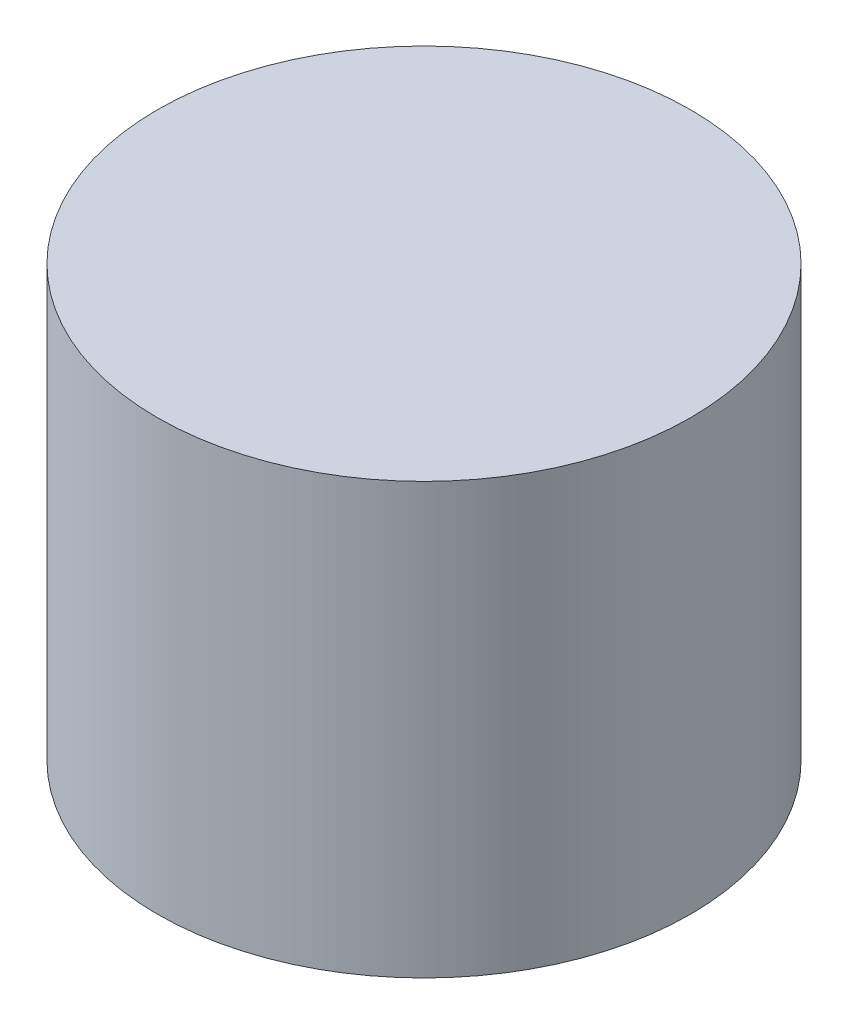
ISO-10303-21;
HEADER;
FILE_DESCRIPTION(('STEP AP214'),'2;1');
FILE_NAME('part.step','',(''),(''),'','','');
FILE_SCHEMA(('AUTOMOTIVE_DESIGN { 1 0 10303 214 1 1 1 1 }'));
ENDSEC;
DATA;
#1=APPLICATION_CONTEXT('core data for automotive mechanical design processes');
#2=APPLICATION_PROTOCOL_DEFINITION('international standard','automotive_design',2000,#1);
#3=PRODUCT_CONTEXT('',#1,'mechanical');
#4=PRODUCT('Part','Part','',(#3));
#5=PRODUCT_RELATED_PRODUCT_CATEGORY('part','',(#4));
#6=PRODUCT_DEFINITION_FORMATION('','',#4);
#7=PRODUCT_DEFINITION_CONTEXT('part definition',#1,'design');
#8=PRODUCT_DEFINITION('design','',#6,#7);
#9=PRODUCT_DEFINITION_SHAPE('','',#8);
#10=(LENGTH_UNIT() NAMED_UNIT(*) SI_UNIT(.MILLI.,.METRE.));
#11=(NAMED_UNIT(*) PLANE_ANGLE_UNIT() SI_UNIT($,.RADIAN.));
#12=(NAMED_UNIT(*) SI_UNIT($,.STERADIAN.) SOLID_ANGLE_UNIT());
#13=UNCERTAINTY_MEASURE_WITH_UNIT(LENGTH_MEASURE(1.E-05),#10,'distance_accuracy_value','');
#14=(GEOMETRIC_REPRESENTATION_CONTEXT(3) GLOBAL_UNCERTAINTY_ASSIGNED_CONTEXT((#13)) GLOBAL_UNIT_ASSIGNED_CONTEXT((#10,
#11,#12)) REPRESENTATION_CONTEXT('',''));
#15=CARTESIAN_POINT('',(0.,0.,0.));
#16=DIRECTION('',(0.,0.,1.));
#17=DIRECTION('',(1.,0.,0.));
#18=AXIS2_PLACEMENT_3D('',#15,#16,#17);
#19=CARTESIAN_POINT('',(0.,50.8,0.));
#20=DIRECTION('',(0.,-1.,0.));
#21=DIRECTION('',(0.,0.,-1.));
#22=AXIS2_PLACEMENT_3D('',#19,#20,#21);
#23=CYLINDRICAL_SURFACE('',#22,31.496);
#24=CARTESIAN_POINT('',(0.,50.8,0.));
#25=DIRECTION('',(0.,1.,0.));
#26=DIRECTION('',(0.,0.,1.));
#27=AXIS2_PLACEMENT_3D('',#24,#25,#26);
#28=CIRCLE('',#27,31.496);
#29=CARTESIAN_POINT('',(0.,50.8,31.496));
#30=VERTEX_POINT('',#29);
#31=EDGE_CURVE('E10',#30,#30,#28,.T.);
#32=ORIENTED_EDGE('',*,*,#31,.F.);
#33=EDGE_LOOP('',(#32));
#34=FACE_BOUND('',#33,.T.);
#35=CARTESIAN_POINT('',(0.,0.,0.));
#36=DIRECTION('',(0.,1.,0.));
#37=DIRECTION('',(0.,0.,1.));
#38=AXIS2_PLACEMENT_3D('',#35,#36,#37);
#39=CIRCLE('',#38,31.496);
#40=CARTESIAN_POINT('',(0.,0.,31.496));
#41=VERTEX_POINT('',#40);
#42=EDGE_CURVE('E36',#41,#41,#39,.T.);
#43=ORIENTED_EDGE('',*,*,#42,.T.);
#44=EDGE_LOOP('',(#43));
#45=FACE_BOUND('',#44,.T.);
#46=ADVANCED_FACE('F30',(#34,#45),#23,.T.);
#47=CARTESIAN_POINT('',(0.,50.8,0.));
#48=DIRECTION('',(0.,1.,0.));
#49=DIRECTION('',(0.,0.,1.));
#50=AXIS2_PLACEMENT_3D('',#47,#48,#49);
#51=PLANE('',#50);
#52=ORIENTED_EDGE('',*,*,#31,.T.);
#53=EDGE_LOOP('',(#52));
#54=FACE_BOUND('',#53,.T.);
#55=ADVANCED_FACE('F45',(#54),#51,.T.);
#56=CARTESIAN_POINT('',(0.,0.,0.));
#57=DIRECTION('',(0.,1.,0.));
#58=DIRECTION('',(0.,0.,1.));
#59=AXIS2_PLACEMENT_3D('',#56,#57,#58);
#60=PLANE('',#59);
#61=ORIENTED_EDGE('',*,*,#42,.F.);
#62=EDGE_LOOP('',(#61));
#63=FACE_BOUND('',#62,.T.);
#64=ADVANCED_FACE('F43',(#63),#60,.F.);
#65=CLOSED_SHELL('',(#46,#55,#64));
#66=MANIFOLD_SOLID_BREP('B2',#65);
#67=ADVANCED_BREP_SHAPE_REPRESENTATION('',(#18,#66),#14);
#68=SHAPE_DEFINITION_REPRESENTATION(#9,#67);
ENDSEC;
END-ISO-10303-21;
